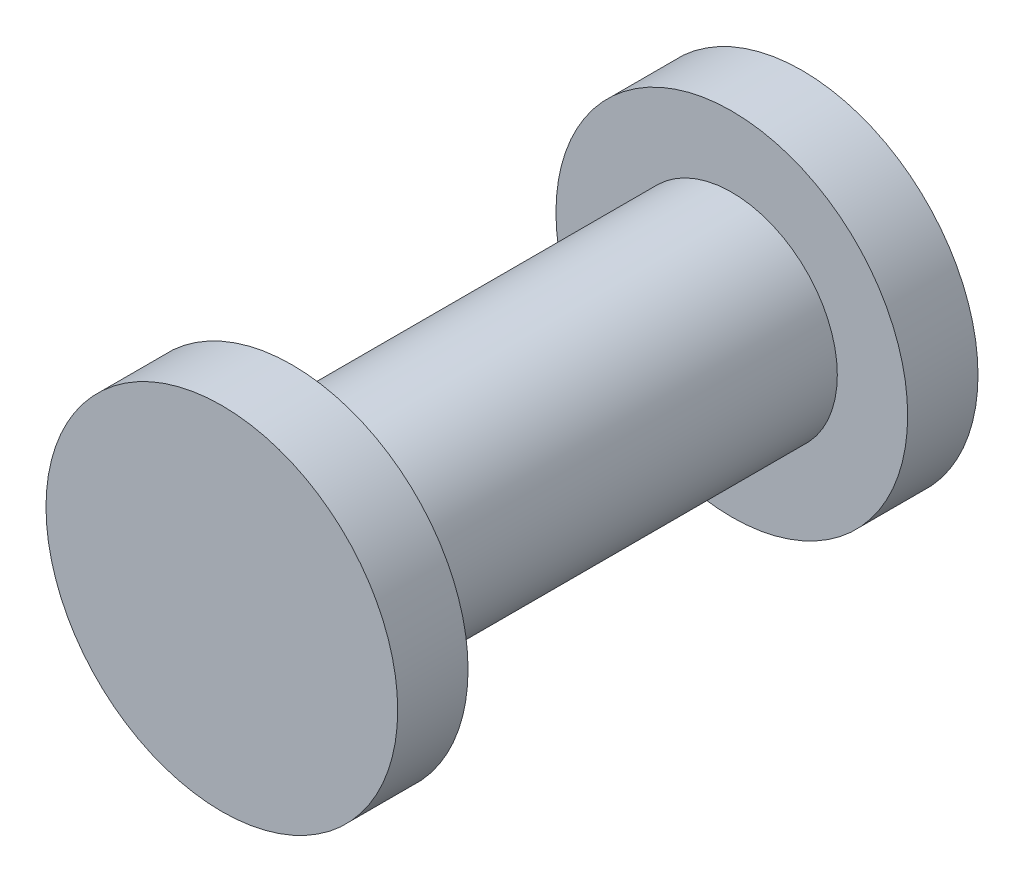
from build123d import *

# Parameters (mm, degrees)
SKETCH_1_R                 = 5
RETAINED_PIN_D6_DEPTH      = 8.25
SKETCH_2_R                 = 5.1
SKETCH_2_R_2               = 3
SHAFT_D6_ENDCAPS_D10_DEPTH = 6.25


with BuildPart() as part:
    # Sketch 1 → Retained_Pin_D6 (new, symmetric)
    with BuildSketch(Plane.XY):
        Circle(SKETCH_1_R)
    extrude(amount=RETAINED_PIN_D6_DEPTH, both=True)

    # Sketch 2 → Shaft_D6_EndCaps_D10 (cut, symmetric)
    with BuildSketch(Plane.XY):
        Circle(SKETCH_2_R)
        Circle(SKETCH_2_R_2, mode=Mode.SUBTRACT)
    extrude(amount=SHAFT_D6_ENDCAPS_D10_DEPTH, both=True, mode=Mode.SUBTRACT)


solid = part.part
